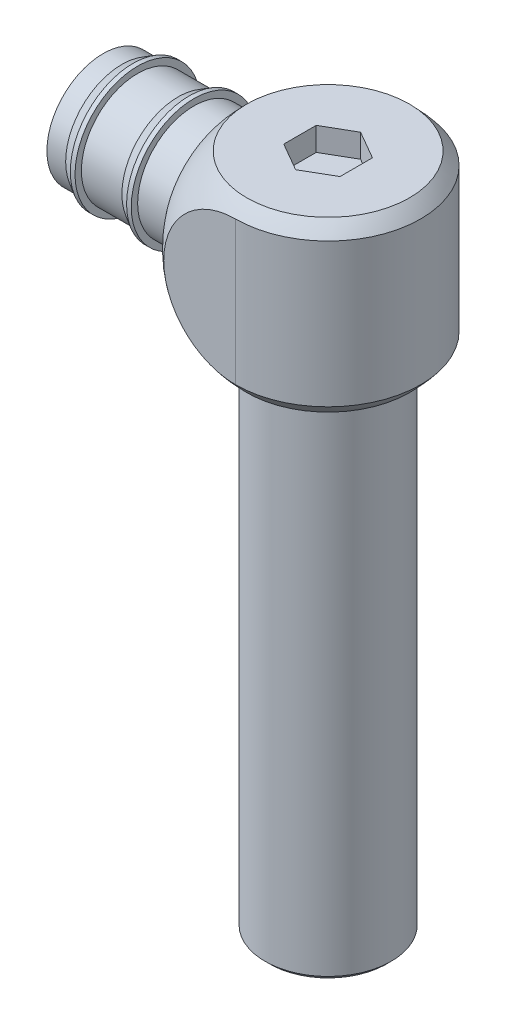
from build123d import *

# Parameters (mm, degrees)
CUT_EXTRUDE1_DEPTH      = 52.173818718
CUT_EXTRUDE1_DEPTH_BACK = 52.173818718
SKETCH3_OUTSIDE_W       = 55.436
SKETCH3_OUTSIDE_H       = 55.436
CUT_EXTRUDE2_DEPTH      = 49.199771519
CUT_EXTRUDE2_DEPTH_BACK = 49.199771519
SKETCH4_OUTSIDE_W       = 45.273
SKETCH4_OUTSIDE_H       = 53.592
SKETCH4_OUTSIDE_W_2     = 50.8
SKETCH4_OUTSIDE_H_2     = 28.575
FILLET1_R               = 1.190625
CUT_EXTRUDE3_START      = -38.1
SKETCH10_R              = 8.255
CUT_EXTRUDE3_DEPTH      = 38.1
SKETCH12_R              = 7.9375
CUT_EXTRUDE4_DEPTH      = 108.2802
CUT_EXTRUDE5_DEPTH      = 3.96875


with BuildPart() as part:
    # Sketch1 → Revolve1 (revolve)
    with BuildSketch(Plane.XY):
        with BuildLine():
            Line((0, 42.79265), (0, 3.10515))
            ThreePointArc((0, 3.10515), (19.84375, 22.9489), (0, 42.79265))
        make_face()
    revolve(axis=Axis((0, 0, 0), (0, 1, 0)))

    # Sketch3 outside → Cut-Extrude1 (cut, two sides: drawn at the far end of the back side and taken through both)
    with BuildSketch(Plane(origin=(0, 0, 0), x_dir=(1, 0, 0), z_dir=(0, 1, 0)).offset(-CUT_EXTRUDE1_DEPTH_BACK)):
        Rectangle(SKETCH3_OUTSIDE_W, SKETCH3_OUTSIDE_H)
        with BuildLine():
            Line((0, -15.6845), (-15.6845, -15.6845))
            Line((-15.6845, -15.6845), (-15.6845, 15.6845))
            Line((-15.6845, 15.6845), (0, 15.6845))
            ThreePointArc((0, 15.6845), (15.6845, 0), (0, -15.6845))
        make_face(mode=Mode.SUBTRACT)
    extrude(amount=CUT_EXTRUDE1_DEPTH + CUT_EXTRUDE1_DEPTH_BACK, mode=Mode.SUBTRACT)

    # Sketch4 outside → Cut-Extrude2 (cut, two sides: drawn at the far end of the back side and taken through both)
    with BuildSketch(Plane.XY.offset(-CUT_EXTRUDE2_DEPTH_BACK)):
        with Locations((0.0005, 22.949)):
            Rectangle(SKETCH4_OUTSIDE_W, SKETCH4_OUTSIDE_H)
        with Locations((0, 22.9489)):
            Rectangle(SKETCH4_OUTSIDE_W_2, SKETCH4_OUTSIDE_H_2, mode=Mode.SUBTRACT)
    extrude(amount=CUT_EXTRUDE2_DEPTH + CUT_EXTRUDE2_DEPTH_BACK, mode=Mode.SUBTRACT)

    # Sketch9 → Revolve2 (revolve)
    with BuildSketch(Plane(origin=(0, 22.9489, 0), x_dir=(1, 0, 0), z_dir=(0, 1, 0)), mode=Mode.PRIVATE) as revolve2_sk:
        Polygon((-38.1, 0), (-38.1, 9.525), (-34.925, 9.525), (-33.055251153, 10.6045), (-32.261501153, 10.6045), (-32.261501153, 9.525), (-25.4, 9.525), (-23.530251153, 10.6045), (-22.736501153, 10.6045), (-22.736501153, 9.525), (0, 9.525), (0, 0), align=None)
    revolve(revolve2_sk.sketch.rotate(Axis((0, 22.9489, 0), (1, 0, 0)), 180), axis=Axis((0, 22.9489, 0), (1, 0, 0)))

    # Fillet1
    fillet1_edges = [part.edges().sort_by_distance(p)[0] for p in [
        (-15.6845, 22.9489, -9.525),
    ]]
    fillet(fillet1_edges, radius=FILLET1_R)

    # Sketch10 → Cut-Extrude3 (cut)
    with BuildSketch(Plane.ZY.offset(38.1).offset(CUT_EXTRUDE3_START)):
        with Locations((0, 22.9489)):
            Circle(SKETCH10_R)
    extrude(amount=CUT_EXTRUDE3_DEPTH, mode=Mode.SUBTRACT)

    # Sketch11 → Revolve3 (revolve)
    with BuildSketch(Plane.XY, mode=Mode.PRIVATE) as revolve3_sk:
        Polygon((10.668, -76.3016), (10.668, 5.4864), (10.668, 8.6614), (0, 8.6614), (0, -77.0636), (9.906, -77.0636), align=None)
    revolve(revolve3_sk.sketch.rotate(Axis((0, -76.529438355, 0), (0, 1, 0)), 90), axis=Axis((0, -76.529438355, 0), (0, 1, 0)))

    # Sketch12 → Cut-Extrude4 (cut)
    with BuildSketch(Plane.XZ.offset(77.0636)):
        with Locations(Location((0, 0, 0), (0, 0, 270))):
            Circle(SKETCH12_R)
    extrude(amount=-CUT_EXTRUDE4_DEPTH, mode=Mode.SUBTRACT)

    # Sketch13 → Cut-Extrude5 (cut)
    with BuildSketch(Plane(origin=(0, 37.2364, 0), x_dir=(1, 0, 0), z_dir=(0, 1, 0))):
        Polygon((4.7625, -2.749630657), (4.7625, 2.749630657), (0, 5.499261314), (-4.7625, 2.749630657), (-4.7625, -2.749630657), (0, -5.499261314), align=None)
    extrude(amount=-CUT_EXTRUDE5_DEPTH, mode=Mode.SUBTRACT)


solid = part.part
